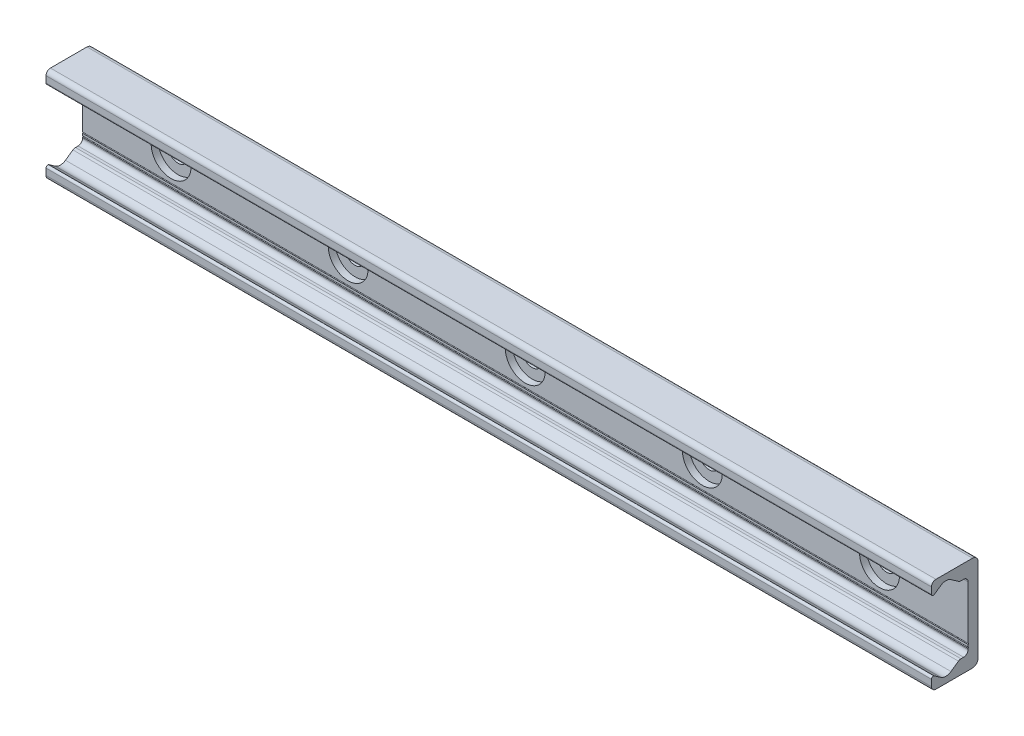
from build123d import *

# Parameters (mm, degrees)
BOSS_EXTRUDE1_DEPTH = 200
SKETCH2_R           = 9
SKETCH2_R_2         = 4.5
CUT_EXTRUDE1_DEPTH  = 3.1
SKETCH2_2_R         = 4.5
CUT_EXTRUDE2_DEPTH  = 202.827896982
LPATTERN1_COUNT     = 5
LPATTERN1_PITCH     = 80


with BuildPart() as part:
    # Sketch1 → Boss-Extrude1 (new, symmetric)
    with BuildSketch(Plane(origin=(0, 0, 0), x_dir=(0, 0, -1), z_dir=(1, 0, 0))):
        with BuildLine():
            Line((0, 0), (0, 19))
            ThreePointArc((0, 19), (-0.732233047, 20.767766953), (-2.5, 21.5))
            Line((-2.5, 21.5), (-19, 21.5))
            ThreePointArc((-19, 21.5), (-20.414213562, 20.914213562), (-21, 19.5))
            Line((-21, 19.5), (-21, 16.625057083))
            ThreePointArc((-21, 16.625057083), (-20.553251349, 15.888838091), (-19.693931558, 15.945160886))
            Line((-19.693931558, 15.945160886), (-16.794305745, 17.975500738))
            ThreePointArc((-16.794305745, 17.975500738), (-14.5, 18.69889256), (-12.205694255, 17.975500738))
            Line((-12.205694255, 17.975500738), (-8.829831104, 15.611695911))
            ThreePointArc((-8.829831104, 15.611695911), (-8.28408983, 15.342566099), (-7.682678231, 15.25))
            Line((-7.682678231, 15.25), (-6.5, 15.25))
            ThreePointArc((-6.5, 15.25), (-5.085786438, 14.664213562), (-4.5, 13.25))
            Line((-4.5, 13.25), (-4.5, -10.75))
            ThreePointArc((-4.5, -10.75), (-4.25, -11), (-4.5, -11.25))
            Line((-4.5, -11.25), (-4.5, -12.25))
            ThreePointArc((-4.5, -12.25), (-4.25, -12.5), (-4.5, -12.75))
            Line((-4.5, -12.75), (-4.5, -13.25))
            ThreePointArc((-4.5, -13.25), (-5.085786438, -14.664213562), (-6.5, -15.25))
            Line((-6.5, -15.25), (-7.682678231, -15.25))
            ThreePointArc((-7.682678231, -15.25), (-8.28408983, -15.342566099), (-8.829831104, -15.611695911))
            Line((-8.829831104, -15.611695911), (-12.205694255, -17.975500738))
            ThreePointArc((-12.205694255, -17.975500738), (-14.5, -18.69889256), (-16.794305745, -17.975500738))
            Line((-16.794305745, -17.975500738), (-19.693931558, -15.945160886))
            ThreePointArc((-19.693931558, -15.945160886), (-20.553251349, -15.888838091), (-21, -16.625057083))
            Line((-21, -16.625057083), (-21, -19.5))
            ThreePointArc((-21, -19.5), (-20.414213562, -20.914213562), (-19, -21.5))
            Line((-19, -21.5), (-2.5, -21.5))
            ThreePointArc((-2.5, -21.5), (-0.732233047, -20.767766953), (0, -19))
            Line((0, -19), (0, 0))
        make_face()
    extrude(amount=BOSS_EXTRUDE1_DEPTH, both=True)

    # Sketch2 → Cut-Extrude1 (cut)
    with BuildSketch(Plane.XY.offset(4.5)):
        with Locations((160, 0)):
            Circle(SKETCH2_R)
        with Locations((160, 0)):
            Circle(SKETCH2_R_2, mode=Mode.SUBTRACT)
    cut_extrude1 = extrude(amount=-CUT_EXTRUDE1_DEPTH, mode=Mode.SUBTRACT)

    # Sketch2_2 → Cut-Extrude2 (cut, through all)
    with BuildSketch(Plane.XY.offset(4.5)):
        with Locations((160, 0)):
            Circle(SKETCH2_2_R)
    cut_extrude2 = extrude(amount=-CUT_EXTRUDE2_DEPTH, mode=Mode.SUBTRACT)

    # LPattern1: Cut-Extrude1, Cut-Extrude2 ×5
    with Locations(*[(-i * LPATTERN1_PITCH, 0, 0) for i in range(1, LPATTERN1_COUNT)]):
        add(cut_extrude1, mode=Mode.SUBTRACT)
        add(cut_extrude2, mode=Mode.SUBTRACT)


solid = part.part
